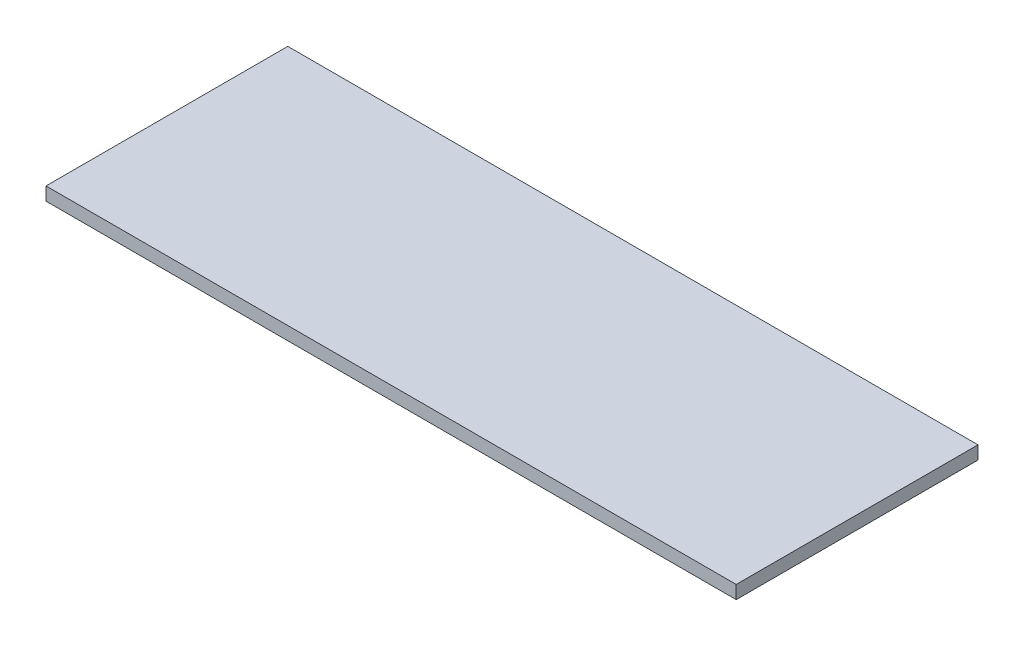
from build123d import *

# Parameters (mm, degrees)
SKETCH1_W      = 79.756
SKETCH1_H      = 27.94
EXTRUDE1_DEPTH = 1.524


with BuildPart() as part:
    # Sketch1 → Extrude1 (new body)
    with BuildSketch(Plane(origin=(0, 0, 0), x_dir=(1, 0, 0), z_dir=(0, 1, 0))):
        with Locations((-8.15125608, -3.790014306)):
            Rectangle(SKETCH1_W, SKETCH1_H)
    extrude(amount=EXTRUDE1_DEPTH)


solid = part.part
